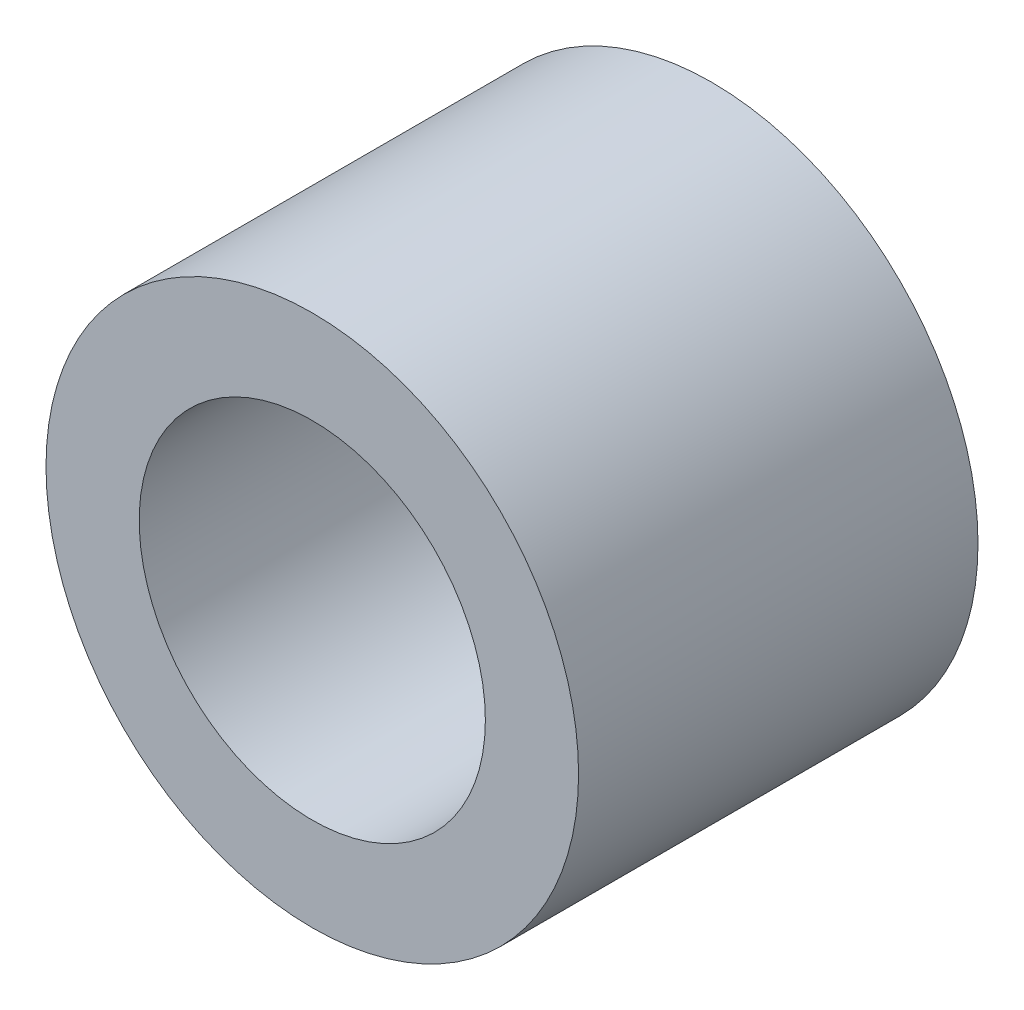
from build123d import *

# Parameters (mm, degrees)
SKETCH_2_R          = 5
EXTRUDE_1_DEPTH     = 7.5
SKETCH_3_R          = 3.25
CUT_EXTRUDE_1_DEPTH = 7.5


with BuildPart() as part:
    # Sketch 2 → Extrude 1 (new body)
    with BuildSketch(Plane.XY):
        Circle(SKETCH_2_R)
    extrude(amount=EXTRUDE_1_DEPTH)

    # Sketch 3 → Cut-Extrude 1 (cut)
    with BuildSketch(Plane.XY.offset(7.5)):
        Circle(SKETCH_3_R)
    extrude(amount=-CUT_EXTRUDE_1_DEPTH, mode=Mode.SUBTRACT)


solid = part.part
